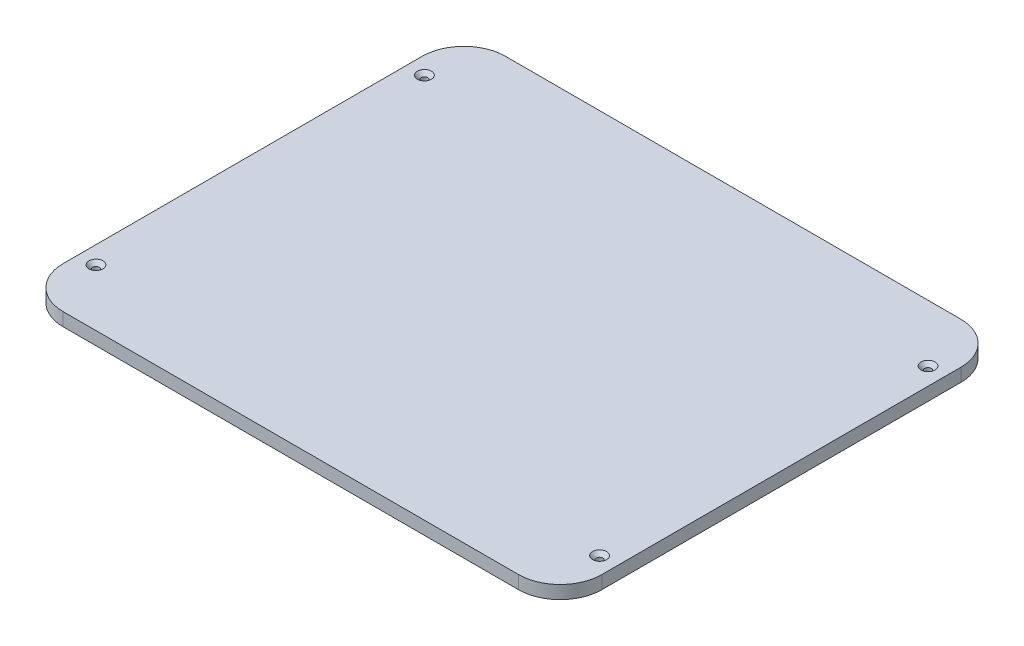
from build123d import *

# Parameters (mm, degrees)
CROQUIS1_W              = 246
CROQUIS1_H              = 202
SALIENTE_EXTRUIR1_DEPTH = 6
REDONDEO1_R             = 19
CROQUIS3_R              = 1.5
CORTAR_EXTRUIR1_DEPTH   = 160.267071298
CHAFL_N1_SIZE           = 1.7


with BuildPart() as part:
    # Croquis1 → Saliente-Extruir1 (new body)
    with BuildSketch(Plane(origin=(0, 0, 0), x_dir=(1, 0, 0), z_dir=(0, 1, 0))):
        Rectangle(CROQUIS1_W, CROQUIS1_H)
    extrude(amount=SALIENTE_EXTRUIR1_DEPTH)

    # Redondeo1
    redondeo1_edges = [part.edges().sort_by_distance(p)[0] for p in [
        (123, 3, 101),
        (-123, 3, 101),
        (-123, 3, -101),
        (123, 3, -101),
    ]]
    fillet(redondeo1_edges, radius=REDONDEO1_R)

    # Croquis3 → Cortar-Extruir1 (cut, through all)
    with BuildSketch(Plane(origin=(0, 6, 0), x_dir=(1, 0, 0), z_dir=(0, 1, 0))):
        with Locations(Location((-115, 75, 0), (0, 0, 270))):
            Circle(CROQUIS3_R)
        with Locations(Location((-115, -75, 0), (0, 0, 270))):
            Circle(CROQUIS3_R)
        with Locations(Location((115, -75, 0), (0, 0, 270))):
            Circle(CROQUIS3_R)
        with Locations(Location((115, 75, 0), (0, 0, 270))):
            Circle(CROQUIS3_R)
    extrude(amount=-CORTAR_EXTRUIR1_DEPTH, mode=Mode.SUBTRACT)

    # Chafl_n1
    chafl_n1_edges = [part.edges().sort_by_distance(p)[0] for p in [
        (115, 6, -76.5),
        (115, 6, 73.5),
        (-115, 6, 73.5),
        (-115, 6, -76.5),
    ]]
    chamfer(chafl_n1_edges, length=CHAFL_N1_SIZE)


solid = part.part
